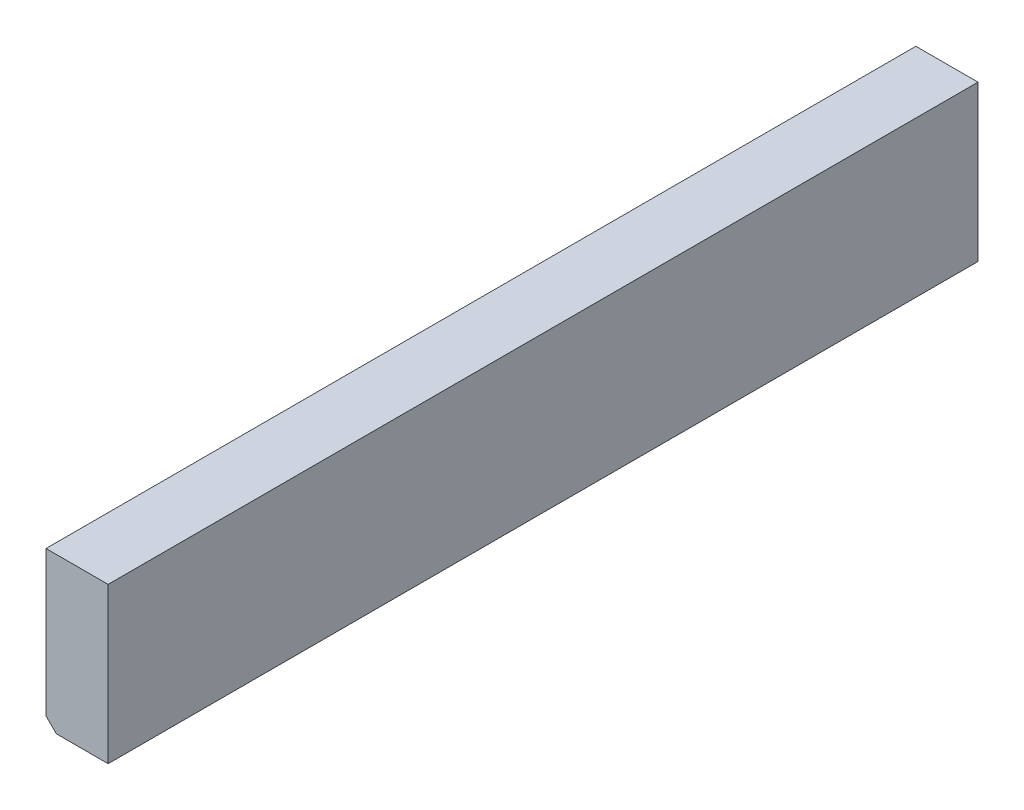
from build123d import *

# Parameters (mm, degrees)
ESQUISSE1_W          = 3
ESQUISSE1_H          = 7.5
BASE_EXTRUSION_DEPTH = 42
CHANFREIN3_SIZE      = 0.5


with BuildPart() as part:
    # Esquisse1 → Base-Extrusion (new body)
    with BuildSketch(Plane.XY):
        with Locations((1.5, 3.75)):
            Rectangle(ESQUISSE1_W, ESQUISSE1_H)
    extrude(amount=-BASE_EXTRUSION_DEPTH)

    # Chanfrein3
    chanfrein3_edges = [part.edges().sort_by_distance(p)[0] for p in [
        (0, 0, -21),
    ]]
    chamfer(chanfrein3_edges, length=CHANFREIN3_SIZE)


solid = part.part
